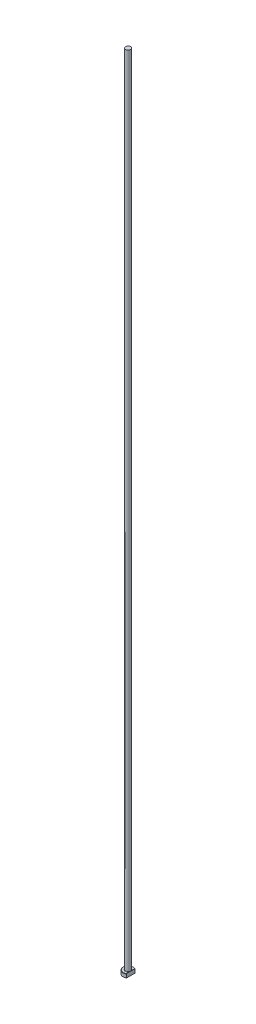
from build123d import *
from build123d.topology import SkipClean

# Parameters (mm, degrees)
CHAMFER1_SIZE = 0.2
FILLET1_R     = 0.2
KEY_DEPTH     = 631.025396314


with BuildPart() as part:
    # Sketch1 → Revolve1 (revolve)
    with BuildSketch(Plane.XY, mode=Mode.PRIVATE) as revolve1_sk:
        Polygon((0, 0), (-4, 0), (-4, 3), (-2, 3), (-2, 630), (0, 630), align=None)
    revolve(revolve1_sk.sketch.rotate(Axis((0, 259.958771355, 0), (0, -1, 0)), 270), axis=Axis((0, 259.958771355, 0), (0, -1, 0)))

    # Chamfer1
    chamfer1_edges = [part.edges().sort_by_distance(p)[0] for p in [
        (0, 3, -4),
        (0, 0, -4),
    ]]
    chamfer(chamfer1_edges, length=CHAMFER1_SIZE)

    # Fillet1
    fillet1_edges = [part.edges().sort_by_distance(p)[0] for p in [
        (0, 3, -2),
    ]]
    fillet(fillet1_edges, radius=FILLET1_R)

    # Sketch2 → KEY (cut, through all)
    with SkipClean():  # the faces are left unmerged after this step: merging them gives an invalid solid
        with BuildSketch(Plane(origin=(0, 0, 0), x_dir=(1, 0, 0), z_dir=(0, 1, 0))):
            with BuildLine():
                Line((2, 3.464101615), (2, -3.464101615))
                ThreePointArc((2, -3.464101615), (4, 0), (2, 3.464101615))
            make_face()
        extrude(amount=KEY_DEPTH, mode=Mode.SUBTRACT)


solid = part.part
